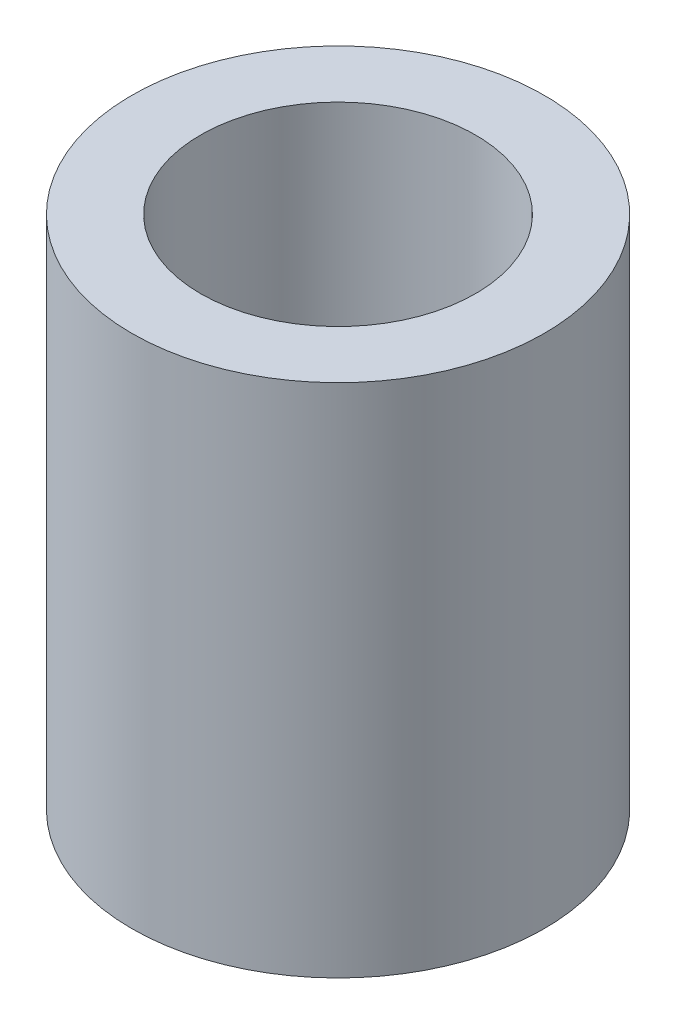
from build123d import *

# Parameters (mm, degrees)
SKETCH_1_R      = 30
SKETCH_1_R_2    = 20
EXTRUDE_1_DEPTH = 75


with BuildPart() as part:
    # Sketch 1 → Extrude 1 (new body)
    with BuildSketch(Plane(origin=(0, 0, 0), x_dir=(1, 0, 0), z_dir=(0, 1, 0))):
        with Locations(Location((0, 0, 0), (0, 0, 270))):
            Circle(SKETCH_1_R)
        with Locations(Location((0, 0, 0), (0, 0, 270))):
            Circle(SKETCH_1_R_2, mode=Mode.SUBTRACT)
    extrude(amount=EXTRUDE_1_DEPTH)


solid = part.part
